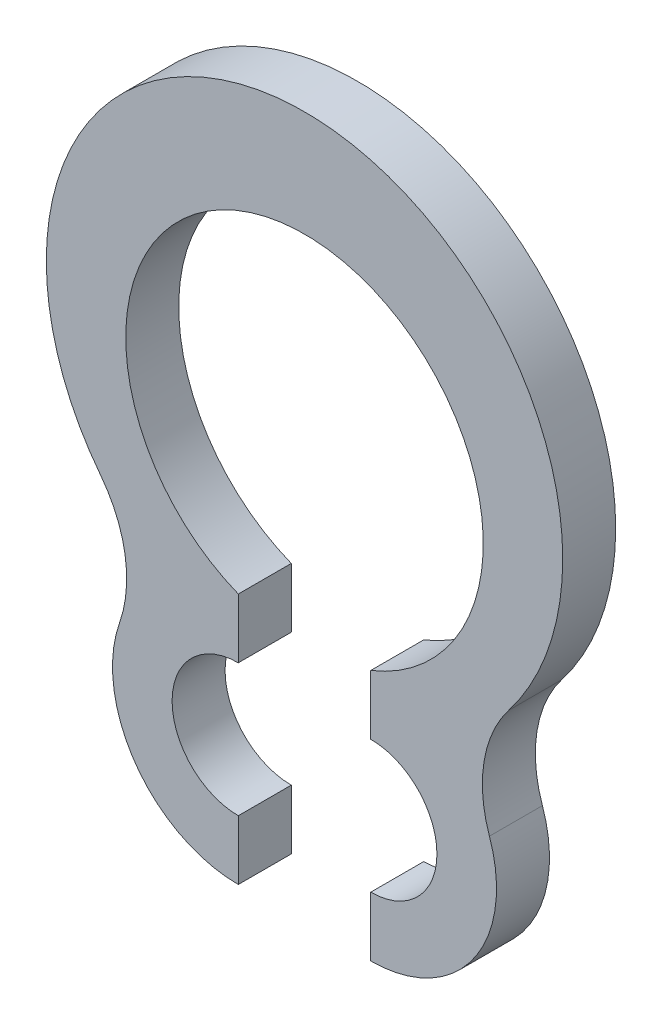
ISO-10303-21;
HEADER;
FILE_DESCRIPTION(('STEP AP214'),'2;1');
FILE_NAME('part.step','',(''),(''),'','','');
FILE_SCHEMA(('AUTOMOTIVE_DESIGN { 1 0 10303 214 1 1 1 1 }'));
ENDSEC;
DATA;
#1=APPLICATION_CONTEXT('core data for automotive mechanical design processes');
#2=APPLICATION_PROTOCOL_DEFINITION('international standard','automotive_design',2000,#1);
#3=PRODUCT_CONTEXT('',#1,'mechanical');
#4=PRODUCT('Part','Part','',(#3));
#5=PRODUCT_RELATED_PRODUCT_CATEGORY('part','',(#4));
#6=PRODUCT_DEFINITION_FORMATION('','',#4);
#7=PRODUCT_DEFINITION_CONTEXT('part definition',#1,'design');
#8=PRODUCT_DEFINITION('design','',#6,#7);
#9=PRODUCT_DEFINITION_SHAPE('','',#8);
#10=(LENGTH_UNIT() NAMED_UNIT(*) SI_UNIT(.MILLI.,.METRE.));
#11=(NAMED_UNIT(*) PLANE_ANGLE_UNIT() SI_UNIT($,.RADIAN.));
#12=(NAMED_UNIT(*) SI_UNIT($,.STERADIAN.) SOLID_ANGLE_UNIT());
#13=UNCERTAINTY_MEASURE_WITH_UNIT(LENGTH_MEASURE(1.E-05),#10,'distance_accuracy_value','');
#14=(GEOMETRIC_REPRESENTATION_CONTEXT(3) GLOBAL_UNCERTAINTY_ASSIGNED_CONTEXT((#13)) GLOBAL_UNIT_ASSIGNED_CONTEXT((#10,
#11,#12)) REPRESENTATION_CONTEXT('',''));
#15=CARTESIAN_POINT('',(0.,0.,0.));
#16=DIRECTION('',(0.,0.,1.));
#17=DIRECTION('',(1.,0.,0.));
#18=AXIS2_PLACEMENT_3D('',#15,#16,#17);
#19=CARTESIAN_POINT('',(-0.5,-2.40399362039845,-0.4));
#20=DIRECTION('',(0.,0.,1.));
#21=DIRECTION('',(1.,0.,0.));
#22=AXIS2_PLACEMENT_3D('',#19,#20,#21);
#23=CYLINDRICAL_SURFACE('',#22,0.5);
#24=CARTESIAN_POINT('',(-0.5,-2.40399362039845,0.));
#25=DIRECTION('',(0.,0.,-1.));
#26=DIRECTION('',(1.,0.,0.));
#27=AXIS2_PLACEMENT_3D('',#24,#25,#26);
#28=CIRCLE('',#27,0.5);
#29=CARTESIAN_POINT('',(-0.5,-2.90399362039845,0.));
#30=VERTEX_POINT('',#29);
#31=CARTESIAN_POINT('',(-0.5,-1.90399362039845,0.));
#32=VERTEX_POINT('',#31);
#33=EDGE_CURVE('E154',#30,#32,#28,.T.);
#34=ORIENTED_EDGE('',*,*,#33,.F.);
#35=DIRECTION('',(0.,0.,1.));
#36=VECTOR('',#35,1.);
#37=CARTESIAN_POINT('',(-0.5,-2.90399362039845,-0.4));
#38=LINE('',#37,#36);
#39=CARTESIAN_POINT('',(-0.5,-2.90399362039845,-0.4));
#40=VERTEX_POINT('',#39);
#41=EDGE_CURVE('E11',#40,#30,#38,.T.);
#42=ORIENTED_EDGE('',*,*,#41,.F.);
#43=CARTESIAN_POINT('',(-0.5,-2.40399362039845,-0.4));
#44=DIRECTION('',(0.,0.,-1.));
#45=DIRECTION('',(1.,0.,0.));
#46=AXIS2_PLACEMENT_3D('',#43,#44,#45);
#47=CIRCLE('',#46,0.5);
#48=CARTESIAN_POINT('',(-0.5,-1.90399362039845,-0.4));
#49=VERTEX_POINT('',#48);
#50=EDGE_CURVE('E186',#40,#49,#47,.T.);
#51=ORIENTED_EDGE('',*,*,#50,.T.);
#52=DIRECTION('',(0.,0.,1.));
#53=VECTOR('',#52,1.);
#54=CARTESIAN_POINT('',(-0.5,-1.90399362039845,-0.4));
#55=LINE('',#54,#53);
#56=EDGE_CURVE('E36',#49,#32,#55,.T.);
#57=ORIENTED_EDGE('',*,*,#56,.T.);
#58=EDGE_LOOP('',(#34,#42,#51,#57));
#59=FACE_BOUND('',#58,.T.);
#60=ADVANCED_FACE('F33',(#59),#23,.F.);
#61=CARTESIAN_POINT('',(-0.5,-2.90399362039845,-0.4));
#62=DIRECTION('',(1.,0.,0.));
#63=DIRECTION('',(0.,0.,-1.));
#64=AXIS2_PLACEMENT_3D('',#61,#62,#63);
#65=PLANE('',#64);
#66=DIRECTION('',(0.,1.,0.));
#67=VECTOR('',#66,1.);
#68=CARTESIAN_POINT('',(-0.5,-2.90399362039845,0.));
#69=LINE('',#68,#67);
#70=CARTESIAN_POINT('',(-0.5,-3.35399362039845,0.));
#71=VERTEX_POINT('',#70);
#72=EDGE_CURVE('E184',#71,#30,#69,.T.);
#73=ORIENTED_EDGE('',*,*,#72,.F.);
#74=DIRECTION('',(0.,0.,1.));
#75=VECTOR('',#74,1.);
#76=CARTESIAN_POINT('',(-0.5,-3.35399362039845,-0.4));
#77=LINE('',#76,#75);
#78=CARTESIAN_POINT('',(-0.5,-3.35399362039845,-0.4));
#79=VERTEX_POINT('',#78);
#80=EDGE_CURVE('E42',#79,#71,#77,.T.);
#81=ORIENTED_EDGE('',*,*,#80,.F.);
#82=DIRECTION('',(0.,1.,0.));
#83=VECTOR('',#82,1.);
#84=CARTESIAN_POINT('',(-0.5,-2.90399362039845,-0.4));
#85=LINE('',#84,#83);
#86=EDGE_CURVE('E144',#79,#40,#85,.T.);
#87=ORIENTED_EDGE('',*,*,#86,.T.);
#88=ORIENTED_EDGE('',*,*,#41,.T.);
#89=EDGE_LOOP('',(#73,#81,#87,#88));
#90=FACE_BOUND('',#89,.T.);
#91=ADVANCED_FACE('F206',(#90),#65,.T.);
#92=CARTESIAN_POINT('',(-0.5,-2.40399362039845,-0.4));
#93=DIRECTION('',(0.,0.,1.));
#94=DIRECTION('',(1.,0.,0.));
#95=AXIS2_PLACEMENT_3D('',#92,#93,#94);
#96=CYLINDRICAL_SURFACE('',#95,0.95);
#97=CARTESIAN_POINT('',(-0.5,-2.40399362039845,0.));
#98=DIRECTION('',(0.,0.,1.));
#99=DIRECTION('',(-1.,0.,0.));
#100=AXIS2_PLACEMENT_3D('',#97,#98,#99);
#101=CIRCLE('',#100,0.95);
#102=CARTESIAN_POINT('',(-1.39650561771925,-2.08970445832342,0.));
#103=VERTEX_POINT('',#102);
#104=EDGE_CURVE('E131',#103,#71,#101,.T.);
#105=ORIENTED_EDGE('',*,*,#104,.F.);
#106=DIRECTION('',(0.,0.,1.));
#107=VECTOR('',#106,1.);
#108=CARTESIAN_POINT('',(-1.39650561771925,-2.08970445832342,-0.4));
#109=LINE('',#108,#107);
#110=CARTESIAN_POINT('',(-1.39650561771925,-2.08970445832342,-0.4));
#111=VERTEX_POINT('',#110);
#112=EDGE_CURVE('E126',#111,#103,#109,.T.);
#113=ORIENTED_EDGE('',*,*,#112,.F.);
#114=CARTESIAN_POINT('',(-0.5,-2.40399362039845,-0.4));
#115=DIRECTION('',(0.,0.,1.));
#116=DIRECTION('',(-1.,0.,0.));
#117=AXIS2_PLACEMENT_3D('',#114,#115,#116);
#118=CIRCLE('',#117,0.95);
#119=EDGE_CURVE('E129',#111,#79,#118,.T.);
#120=ORIENTED_EDGE('',*,*,#119,.T.);
#121=ORIENTED_EDGE('',*,*,#80,.T.);
#122=EDGE_LOOP('',(#105,#113,#120,#121));
#123=FACE_BOUND('',#122,.T.);
#124=ADVANCED_FACE('F128',(#123),#96,.T.);
#125=CARTESIAN_POINT('',(-2.2930112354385,-1.7754152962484,-0.4));
#126=DIRECTION('',(0.,0.,1.));
#127=DIRECTION('',(1.,0.,0.));
#128=AXIS2_PLACEMENT_3D('',#125,#126,#127);
#129=CYLINDRICAL_SURFACE('',#128,0.95);
#130=CARTESIAN_POINT('',(-2.2930112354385,-1.7754152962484,0.));
#131=DIRECTION('',(0.,0.,-1.));
#132=DIRECTION('',(-1.,0.,0.));
#133=AXIS2_PLACEMENT_3D('',#130,#131,#132);
#134=CIRCLE('',#133,0.95);
#135=CARTESIAN_POINT('',(-1.54185238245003,-1.19381373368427,0.));
#136=VERTEX_POINT('',#135);
#137=EDGE_CURVE('E181',#136,#103,#134,.T.);
#138=ORIENTED_EDGE('',*,*,#137,.F.);
#139=DIRECTION('',(0.,0.,1.));
#140=VECTOR('',#139,1.);
#141=CARTESIAN_POINT('',(-1.54185238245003,-1.19381373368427,-0.4));
#142=LINE('',#141,#140);
#143=CARTESIAN_POINT('',(-1.54185238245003,-1.19381373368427,-0.4));
#144=VERTEX_POINT('',#143);
#145=EDGE_CURVE('E136',#144,#136,#142,.T.);
#146=ORIENTED_EDGE('',*,*,#145,.F.);
#147=CARTESIAN_POINT('',(-2.2930112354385,-1.7754152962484,-0.4));
#148=DIRECTION('',(0.,0.,-1.));
#149=DIRECTION('',(-1.,0.,0.));
#150=AXIS2_PLACEMENT_3D('',#147,#148,#149);
#151=CIRCLE('',#150,0.95);
#152=EDGE_CURVE('E142',#144,#111,#151,.T.);
#153=ORIENTED_EDGE('',*,*,#152,.T.);
#154=ORIENTED_EDGE('',*,*,#112,.T.);
#155=EDGE_LOOP('',(#138,#146,#153,#154));
#156=FACE_BOUND('',#155,.T.);
#157=ADVANCED_FACE('F146',(#156),#129,.F.);
#158=CARTESIAN_POINT('',(0.,0.,-0.4));
#159=DIRECTION('',(0.,0.,1.));
#160=DIRECTION('',(1.,0.,0.));
#161=AXIS2_PLACEMENT_3D('',#158,#159,#160);
#162=CYLINDRICAL_SURFACE('',#161,1.95);
#163=CARTESIAN_POINT('',(0.,0.,0.));
#164=DIRECTION('',(0.,0.,1.));
#165=DIRECTION('',(1.,0.,0.));
#166=AXIS2_PLACEMENT_3D('',#163,#164,#165);
#167=CIRCLE('',#166,1.95);
#168=CARTESIAN_POINT('',(1.54185238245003,-1.19381373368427,0.));
#169=VERTEX_POINT('',#168);
#170=EDGE_CURVE('E178',#169,#136,#167,.T.);
#171=ORIENTED_EDGE('',*,*,#170,.F.);
#172=DIRECTION('',(0.,0.,1.));
#173=VECTOR('',#172,1.);
#174=CARTESIAN_POINT('',(1.54185238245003,-1.19381373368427,-0.4));
#175=LINE('',#174,#173);
#176=CARTESIAN_POINT('',(1.54185238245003,-1.19381373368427,-0.4));
#177=VERTEX_POINT('',#176);
#178=EDGE_CURVE('E190',#177,#169,#175,.T.);
#179=ORIENTED_EDGE('',*,*,#178,.F.);
#180=CARTESIAN_POINT('',(0.,0.,-0.4));
#181=DIRECTION('',(0.,0.,1.));
#182=DIRECTION('',(1.,0.,0.));
#183=AXIS2_PLACEMENT_3D('',#180,#181,#182);
#184=CIRCLE('',#183,1.95);
#185=EDGE_CURVE('E147',#177,#144,#184,.T.);
#186=ORIENTED_EDGE('',*,*,#185,.T.);
#187=ORIENTED_EDGE('',*,*,#145,.T.);
#188=EDGE_LOOP('',(#171,#179,#186,#187));
#189=FACE_BOUND('',#188,.T.);
#190=ADVANCED_FACE('F219',(#189),#162,.T.);
#191=CARTESIAN_POINT('',(2.2930112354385,-1.77541529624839,-0.4));
#192=DIRECTION('',(0.,0.,1.));
#193=DIRECTION('',(1.,0.,0.));
#194=AXIS2_PLACEMENT_3D('',#191,#192,#193);
#195=CYLINDRICAL_SURFACE('',#194,0.95);
#196=CARTESIAN_POINT('',(2.2930112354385,-1.77541529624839,0.));
#197=DIRECTION('',(0.,0.,-1.));
#198=DIRECTION('',(1.,0.,0.));
#199=AXIS2_PLACEMENT_3D('',#196,#197,#198);
#200=CIRCLE('',#199,0.95);
#201=CARTESIAN_POINT('',(1.39650561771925,-2.08970445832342,0.));
#202=VERTEX_POINT('',#201);
#203=EDGE_CURVE('E175',#202,#169,#200,.T.);
#204=ORIENTED_EDGE('',*,*,#203,.F.);
#205=DIRECTION('',(0.,0.,1.));
#206=VECTOR('',#205,1.);
#207=CARTESIAN_POINT('',(1.39650561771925,-2.08970445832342,-0.4));
#208=LINE('',#207,#206);
#209=CARTESIAN_POINT('',(1.39650561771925,-2.08970445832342,-0.4));
#210=VERTEX_POINT('',#209);
#211=EDGE_CURVE('E192',#210,#202,#208,.T.);
#212=ORIENTED_EDGE('',*,*,#211,.F.);
#213=CARTESIAN_POINT('',(2.2930112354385,-1.77541529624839,-0.4));
#214=DIRECTION('',(0.,0.,-1.));
#215=DIRECTION('',(1.,0.,0.));
#216=AXIS2_PLACEMENT_3D('',#213,#214,#215);
#217=CIRCLE('',#216,0.95);
#218=EDGE_CURVE('E149',#210,#177,#217,.T.);
#219=ORIENTED_EDGE('',*,*,#218,.T.);
#220=ORIENTED_EDGE('',*,*,#178,.T.);
#221=EDGE_LOOP('',(#204,#212,#219,#220));
#222=FACE_BOUND('',#221,.T.);
#223=ADVANCED_FACE('F222',(#222),#195,.F.);
#224=CARTESIAN_POINT('',(0.5,-2.40399362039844,-0.4));
#225=DIRECTION('',(0.,0.,1.));
#226=DIRECTION('',(1.,0.,0.));
#227=AXIS2_PLACEMENT_3D('',#224,#225,#226);
#228=CYLINDRICAL_SURFACE('',#227,0.95);
#229=CARTESIAN_POINT('',(0.5,-2.40399362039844,0.));
#230=DIRECTION('',(0.,0.,1.));
#231=DIRECTION('',(1.,0.,0.));
#232=AXIS2_PLACEMENT_3D('',#229,#230,#231);
#233=CIRCLE('',#232,0.95);
#234=CARTESIAN_POINT('',(0.5,-3.35399362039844,0.));
#235=VERTEX_POINT('',#234);
#236=EDGE_CURVE('E172',#235,#202,#233,.T.);
#237=ORIENTED_EDGE('',*,*,#236,.F.);
#238=DIRECTION('',(0.,0.,1.));
#239=VECTOR('',#238,1.);
#240=CARTESIAN_POINT('',(0.5,-3.35399362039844,-0.4));
#241=LINE('',#240,#239);
#242=CARTESIAN_POINT('',(0.5,-3.35399362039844,-0.4));
#243=VERTEX_POINT('',#242);
#244=EDGE_CURVE('E194',#243,#235,#241,.T.);
#245=ORIENTED_EDGE('',*,*,#244,.F.);
#246=CARTESIAN_POINT('',(0.5,-2.40399362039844,-0.4));
#247=DIRECTION('',(0.,0.,1.));
#248=DIRECTION('',(1.,0.,0.));
#249=AXIS2_PLACEMENT_3D('',#246,#247,#248);
#250=CIRCLE('',#249,0.95);
#251=EDGE_CURVE('E348',#243,#210,#250,.T.);
#252=ORIENTED_EDGE('',*,*,#251,.T.);
#253=ORIENTED_EDGE('',*,*,#211,.T.);
#254=EDGE_LOOP('',(#237,#245,#252,#253));
#255=FACE_BOUND('',#254,.T.);
#256=ADVANCED_FACE('F226',(#255),#228,.T.);
#257=CARTESIAN_POINT('',(0.5,-2.90399362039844,-0.4));
#258=DIRECTION('',(-1.,0.,0.));
#259=DIRECTION('',(0.,0.,1.));
#260=AXIS2_PLACEMENT_3D('',#257,#258,#259);
#261=PLANE('',#260);
#262=DIRECTION('',(0.,-1.,0.));
#263=VECTOR('',#262,1.);
#264=CARTESIAN_POINT('',(0.5,-2.90399362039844,0.));
#265=LINE('',#264,#263);
#266=CARTESIAN_POINT('',(0.5,-2.90399362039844,0.));
#267=VERTEX_POINT('',#266);
#268=EDGE_CURVE('E169',#267,#235,#265,.T.);
#269=ORIENTED_EDGE('',*,*,#268,.F.);
#270=DIRECTION('',(0.,0.,1.));
#271=VECTOR('',#270,1.);
#272=CARTESIAN_POINT('',(0.5,-2.90399362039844,-0.4));
#273=LINE('',#272,#271);
#274=CARTESIAN_POINT('',(0.5,-2.90399362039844,-0.4));
#275=VERTEX_POINT('',#274);
#276=EDGE_CURVE('E196',#275,#267,#273,.T.);
#277=ORIENTED_EDGE('',*,*,#276,.F.);
#278=DIRECTION('',(0.,-1.,0.));
#279=VECTOR('',#278,1.);
#280=CARTESIAN_POINT('',(0.5,-2.90399362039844,-0.4));
#281=LINE('',#280,#279);
#282=EDGE_CURVE('E352',#275,#243,#281,.T.);
#283=ORIENTED_EDGE('',*,*,#282,.T.);
#284=ORIENTED_EDGE('',*,*,#244,.T.);
#285=EDGE_LOOP('',(#269,#277,#283,#284));
#286=FACE_BOUND('',#285,.T.);
#287=ADVANCED_FACE('F230',(#286),#261,.T.);
#288=CARTESIAN_POINT('',(0.5,-2.40399362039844,-0.4));
#289=DIRECTION('',(0.,0.,1.));
#290=DIRECTION('',(1.,0.,0.));
#291=AXIS2_PLACEMENT_3D('',#288,#289,#290);
#292=CYLINDRICAL_SURFACE('',#291,0.5);
#293=CARTESIAN_POINT('',(0.5,-2.40399362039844,0.));
#294=DIRECTION('',(0.,0.,-1.));
#295=DIRECTION('',(-1.,0.,0.));
#296=AXIS2_PLACEMENT_3D('',#293,#294,#295);
#297=CIRCLE('',#296,0.5);
#298=CARTESIAN_POINT('',(0.5,-1.90399362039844,0.));
#299=VERTEX_POINT('',#298);
#300=EDGE_CURVE('E166',#299,#267,#297,.T.);
#301=ORIENTED_EDGE('',*,*,#300,.F.);
#302=DIRECTION('',(0.,0.,1.));
#303=VECTOR('',#302,1.);
#304=CARTESIAN_POINT('',(0.5,-1.90399362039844,-0.4));
#305=LINE('',#304,#303);
#306=CARTESIAN_POINT('',(0.5,-1.90399362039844,-0.4));
#307=VERTEX_POINT('',#306);
#308=EDGE_CURVE('E198',#307,#299,#305,.T.);
#309=ORIENTED_EDGE('',*,*,#308,.F.);
#310=CARTESIAN_POINT('',(0.5,-2.40399362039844,-0.4));
#311=DIRECTION('',(0.,0.,-1.));
#312=DIRECTION('',(-1.,0.,0.));
#313=AXIS2_PLACEMENT_3D('',#310,#311,#312);
#314=CIRCLE('',#313,0.5);
#315=EDGE_CURVE('E341',#307,#275,#314,.T.);
#316=ORIENTED_EDGE('',*,*,#315,.T.);
#317=ORIENTED_EDGE('',*,*,#276,.T.);
#318=EDGE_LOOP('',(#301,#309,#316,#317));
#319=FACE_BOUND('',#318,.T.);
#320=ADVANCED_FACE('F234',(#319),#292,.F.);
#321=CARTESIAN_POINT('',(0.5,-1.45399362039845,-0.4));
#322=DIRECTION('',(-1.,0.,0.));
#323=DIRECTION('',(0.,-1.,0.));
#324=AXIS2_PLACEMENT_3D('',#321,#322,#323);
#325=PLANE('',#324);
#326=DIRECTION('',(0.,-1.,0.));
#327=VECTOR('',#326,1.);
#328=CARTESIAN_POINT('',(0.5,-1.45399362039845,0.));
#329=LINE('',#328,#327);
#330=CARTESIAN_POINT('',(0.5,-1.45399362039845,0.));
#331=VERTEX_POINT('',#330);
#332=EDGE_CURVE('E163',#331,#299,#329,.T.);
#333=ORIENTED_EDGE('',*,*,#332,.F.);
#334=DIRECTION('',(0.,0.,1.));
#335=VECTOR('',#334,1.);
#336=CARTESIAN_POINT('',(0.5,-1.45399362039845,-0.4));
#337=LINE('',#336,#335);
#338=CARTESIAN_POINT('',(0.5,-1.45399362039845,-0.4));
#339=VERTEX_POINT('',#338);
#340=EDGE_CURVE('E200',#339,#331,#337,.T.);
#341=ORIENTED_EDGE('',*,*,#340,.F.);
#342=DIRECTION('',(0.,-1.,0.));
#343=VECTOR('',#342,1.);
#344=CARTESIAN_POINT('',(0.5,-1.45399362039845,-0.4));
#345=LINE('',#344,#343);
#346=EDGE_CURVE('E337',#339,#307,#345,.T.);
#347=ORIENTED_EDGE('',*,*,#346,.T.);
#348=ORIENTED_EDGE('',*,*,#308,.T.);
#349=EDGE_LOOP('',(#333,#341,#347,#348));
#350=FACE_BOUND('',#349,.T.);
#351=ADVANCED_FACE('F238',(#350),#325,.T.);
#352=CARTESIAN_POINT('',(0.,-0.2,-0.4));
#353=DIRECTION('',(0.,0.,1.));
#354=DIRECTION('',(1.,0.,0.));
#355=AXIS2_PLACEMENT_3D('',#352,#353,#354);
#356=CYLINDRICAL_SURFACE('',#355,1.35);
#357=CARTESIAN_POINT('',(0.,-0.2,0.));
#358=DIRECTION('',(0.,0.,-1.));
#359=DIRECTION('',(1.,0.,0.));
#360=AXIS2_PLACEMENT_3D('',#357,#358,#359);
#361=CIRCLE('',#360,1.35);
#362=CARTESIAN_POINT('',(-0.5,-1.45399362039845,0.));
#363=VERTEX_POINT('',#362);
#364=EDGE_CURVE('E160',#363,#331,#361,.T.);
#365=ORIENTED_EDGE('',*,*,#364,.F.);
#366=DIRECTION('',(0.,0.,1.));
#367=VECTOR('',#366,1.);
#368=CARTESIAN_POINT('',(-0.5,-1.45399362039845,-0.4));
#369=LINE('',#368,#367);
#370=CARTESIAN_POINT('',(-0.5,-1.45399362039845,-0.4));
#371=VERTEX_POINT('',#370);
#372=EDGE_CURVE('E201',#371,#363,#369,.T.);
#373=ORIENTED_EDGE('',*,*,#372,.F.);
#374=CARTESIAN_POINT('',(0.,-0.2,-0.4));
#375=DIRECTION('',(0.,0.,-1.));
#376=DIRECTION('',(1.,0.,0.));
#377=AXIS2_PLACEMENT_3D('',#374,#375,#376);
#378=CIRCLE('',#377,1.35);
#379=EDGE_CURVE('E358',#371,#339,#378,.T.);
#380=ORIENTED_EDGE('',*,*,#379,.T.);
#381=ORIENTED_EDGE('',*,*,#340,.T.);
#382=EDGE_LOOP('',(#365,#373,#380,#381));
#383=FACE_BOUND('',#382,.T.);
#384=ADVANCED_FACE('F242',(#383),#356,.F.);
#385=CARTESIAN_POINT('',(-0.5,-1.45399362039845,-0.4));
#386=DIRECTION('',(1.,0.,0.));
#387=DIRECTION('',(0.,1.,0.));
#388=AXIS2_PLACEMENT_3D('',#385,#386,#387);
#389=PLANE('',#388);
#390=DIRECTION('',(0.,1.,0.));
#391=VECTOR('',#390,1.);
#392=CARTESIAN_POINT('',(-0.5,-1.45399362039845,0.));
#393=LINE('',#392,#391);
#394=EDGE_CURVE('E157',#32,#363,#393,.T.);
#395=ORIENTED_EDGE('',*,*,#394,.F.);
#396=ORIENTED_EDGE('',*,*,#56,.F.);
#397=DIRECTION('',(0.,1.,0.));
#398=VECTOR('',#397,1.);
#399=CARTESIAN_POINT('',(-0.5,-1.45399362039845,-0.4));
#400=LINE('',#399,#398);
#401=EDGE_CURVE('E360',#49,#371,#400,.T.);
#402=ORIENTED_EDGE('',*,*,#401,.T.);
#403=ORIENTED_EDGE('',*,*,#372,.T.);
#404=EDGE_LOOP('',(#395,#396,#402,#403));
#405=FACE_BOUND('',#404,.T.);
#406=ADVANCED_FACE('F203',(#405),#389,.T.);
#407=CARTESIAN_POINT('',(-0.5,-2.40399362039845,-0.4));
#408=DIRECTION('',(0.,0.,1.));
#409=DIRECTION('',(1.,0.,0.));
#410=AXIS2_PLACEMENT_3D('',#407,#408,#409);
#411=PLANE('',#410);
#412=ORIENTED_EDGE('',*,*,#50,.F.);
#413=ORIENTED_EDGE('',*,*,#86,.F.);
#414=ORIENTED_EDGE('',*,*,#119,.F.);
#415=ORIENTED_EDGE('',*,*,#152,.F.);
#416=ORIENTED_EDGE('',*,*,#185,.F.);
#417=ORIENTED_EDGE('',*,*,#218,.F.);
#418=ORIENTED_EDGE('',*,*,#251,.F.);
#419=ORIENTED_EDGE('',*,*,#282,.F.);
#420=ORIENTED_EDGE('',*,*,#315,.F.);
#421=ORIENTED_EDGE('',*,*,#346,.F.);
#422=ORIENTED_EDGE('',*,*,#379,.F.);
#423=ORIENTED_EDGE('',*,*,#401,.F.);
#424=EDGE_LOOP('',(#412,#413,#414,#415,#416,#417,#418,#419,#420,#421,#422,#423));
#425=FACE_BOUND('',#424,.T.);
#426=ADVANCED_FACE('F140',(#425),#411,.F.);
#427=CARTESIAN_POINT('',(-0.5,-2.40399362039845,0.));
#428=DIRECTION('',(0.,0.,1.));
#429=DIRECTION('',(1.,0.,0.));
#430=AXIS2_PLACEMENT_3D('',#427,#428,#429);
#431=PLANE('',#430);
#432=ORIENTED_EDGE('',*,*,#33,.T.);
#433=ORIENTED_EDGE('',*,*,#394,.T.);
#434=ORIENTED_EDGE('',*,*,#364,.T.);
#435=ORIENTED_EDGE('',*,*,#332,.T.);
#436=ORIENTED_EDGE('',*,*,#300,.T.);
#437=ORIENTED_EDGE('',*,*,#268,.T.);
#438=ORIENTED_EDGE('',*,*,#236,.T.);
#439=ORIENTED_EDGE('',*,*,#203,.T.);
#440=ORIENTED_EDGE('',*,*,#170,.T.);
#441=ORIENTED_EDGE('',*,*,#137,.T.);
#442=ORIENTED_EDGE('',*,*,#104,.T.);
#443=ORIENTED_EDGE('',*,*,#72,.T.);
#444=EDGE_LOOP('',(#432,#433,#434,#435,#436,#437,#438,#439,#440,#441,#442,#443));
#445=FACE_BOUND('',#444,.T.);
#446=ADVANCED_FACE('F205',(#445),#431,.T.);
#447=CLOSED_SHELL('',(#60,#91,#124,#157,#190,#223,#256,#287,#320,#351,#384,#406,#426,#446));
#448=MANIFOLD_SOLID_BREP('B2',#447);
#449=ADVANCED_BREP_SHAPE_REPRESENTATION('',(#18,#448),#14);
#450=SHAPE_DEFINITION_REPRESENTATION(#9,#449);
ENDSEC;
END-ISO-10303-21;
